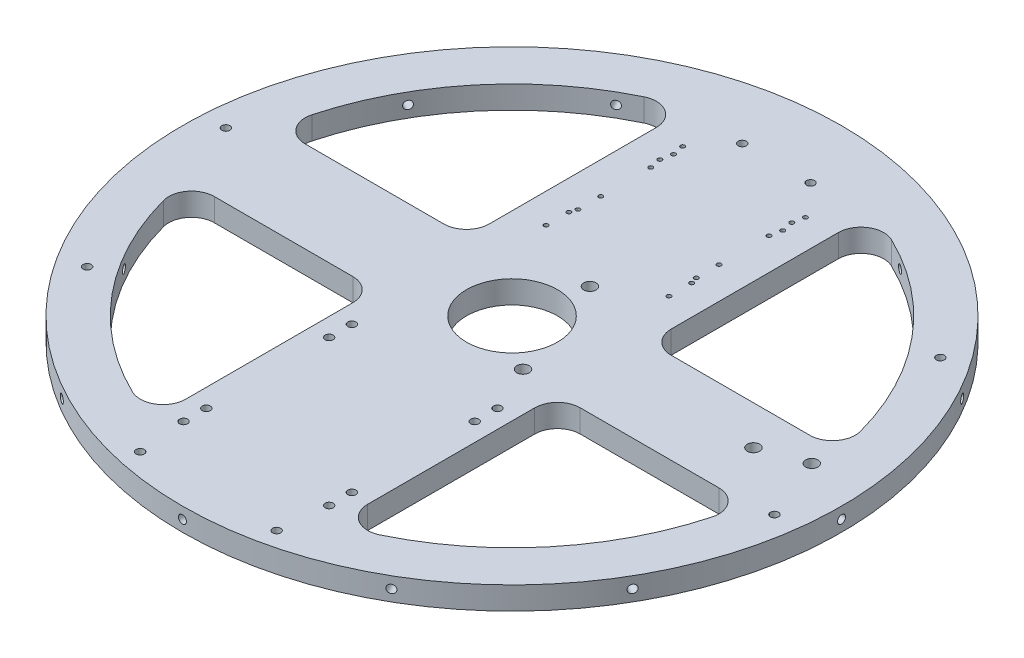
from build123d import *

# Parameters (mm, degrees)
SKETCH1_R             = 92
SKETCH1_R_2           = 12.7
BOSS_EXTRUDE1_DEPTH   = 6.35
CUT_EXTRUDE2_DEPTH    = 131.262513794
MIRROR2_COPY_1_DEPTH  = 131.262513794
F_0_80_TAPPED_HOLE1_D = 1.19126
LPATTERN1_COUNT       = 2
LPATTERN1_PITCH       = 6.35
F_4_40_TAPPED_HOLE1_D = 2.2606
LPATTERN2_COUNT       = 2
LPATTERN2_PITCH       = 6.35
F_8_32_TAPPED_HOLE1_D = 3.4544
CIRPATTERN1_COUNT     = 12
F_4_40_TAPPED_HOLE3_D = 2.2606
F_4_40_TAPPED_HOLE5_D = 2.2606


with BuildPart() as part:
    # Sketch1 → Boss-Extrude1 (new body)
    with BuildSketch(Plane(origin=(0, 0, 0), x_dir=(1, 0, 0), z_dir=(0, 1, 0))):
        with Locations(Location((0, 0, 0), (0, 0, 270))):
            Circle(SKETCH1_R)
        with Locations(Location((0, 0, 0), (0, 0, 270))):
            Circle(SKETCH1_R_2, mode=Mode.SUBTRACT)
    extrude(amount=BOSS_EXTRUDE1_DEPTH)

    # Sketch3 → Cut-Extrude2 (cut, through all)
    with BuildSketch(Plane(origin=(0, 6.35, 0), x_dir=(1, 0, 0), z_dir=(0, 1, 0))):
        with BuildLine():
            Line((70.418747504, -12.7), (31.75, -12.7))
            ThreePointArc((31.75, -12.7), (27.259871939, -14.559871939), (25.4, -19.05))
            Line((25.4, -19.05), (25.4, -65.678306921))
            ThreePointArc((25.4, -65.678306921), (28.375614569, -71.057528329), (34.513708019, -71.395335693))
            ThreePointArc((34.513708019, -71.395335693), (61.040924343, -50.621097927), (76.548412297, -20.708224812))
            ThreePointArc((76.548412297, -20.708224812), (75.46117884, -15.190416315), (70.418747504, -12.7))
        make_face()
    cut_extrude2 = extrude(amount=-CUT_EXTRUDE2_DEPTH, mode=Mode.SUBTRACT)

    # Mirror1: Cut-Extrude2 across plane
    add(cut_extrude2.mirror(Plane(origin=(0, 0, 0), x_dir=(0, 0, 1), z_dir=(1, 0, 0))), mode=Mode.SUBTRACT)

    # Mirror2: Cut-Extrude2 across plane
    add(cut_extrude2.mirror(Plane.XY), mode=Mode.SUBTRACT)

    # Mirror2 copy 1 sketch → Mirror2 copy 1 (cut, through all)
    with BuildSketch(Plane(origin=(0, 6.35, 0), x_dir=(-1, 0, 0), z_dir=(0, 1, 0))):
        with BuildLine():
            Line((70.418747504, -12.7), (31.75, -12.7))
            ThreePointArc((31.75, -12.7), (27.259871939, -14.559871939), (25.4, -19.05))
            Line((25.4, -19.05), (25.4, -65.678306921))
            ThreePointArc((25.4, -65.678306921), (28.375614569, -71.057528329), (34.513708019, -71.395335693))
            ThreePointArc((34.513708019, -71.395335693), (61.040924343, -50.621097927), (76.548412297, -20.708224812))
            ThreePointArc((76.548412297, -20.708224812), (75.46117884, -15.190416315), (70.418747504, -12.7))
        make_face()
    extrude(amount=-MIRROR2_COPY_1_DEPTH, mode=Mode.SUBTRACT)

    # 0-80 Tapped Hole1 (through all)
    with Locations(Plane(origin=(0, 6.35, 0), x_dir=(1, 0, 0), z_dir=(0, 1, 0))):
        with Locations((-17.145, 33.02), (17.145, 64.77), (-17.145, 64.77), (17.145, 33.02), (-16.51, 41.275), (-16.51, 61.595), (16.51, 61.595), (16.51, 41.275)):
            f_0_80_tapped_hole1 = Hole(F_0_80_TAPPED_HOLE1_D / 2)

    # LPattern1: 0-80 Tapped Hole1 ×2
    with Locations(*[(0, 0, i * LPATTERN1_PITCH) for i in range(1, LPATTERN1_COUNT)]):
        add(f_0_80_tapped_hole1, mode=Mode.SUBTRACT)

    # 4-40 Tapped Hole1 (through all)
    with Locations(Plane(origin=(0, 6.35, 0), x_dir=(1, 0, 0), z_dir=(0, 1, 0))):
        with Locations((-20.32, -30.734), (20.32, -30.734), (-20.32, -71.374), (20.32, -71.374)):
            f_4_40_tapped_hole1 = Hole(F_4_40_TAPPED_HOLE1_D / 2)

    # LPattern2: 4-40 Tapped Hole1 ×2
    with Locations(*[(0, 0, -i * LPATTERN2_PITCH) for i in range(1, LPATTERN2_COUNT)]):
        add(f_4_40_tapped_hole1, mode=Mode.SUBTRACT)

    # 8-32 Tapped Hole1 (through all)
    with Locations(Plane(origin=(0, 6.35, 0), x_dir=(1, 0, 0), z_dir=(0, 1, 0))):
        with Locations((65.582523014, 1.820322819), (77.516619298, 6.16397864), (3.757051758, 17.990975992), (14.442445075, -11.366900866)):
            Hole(F_8_32_TAPPED_HOLE1_D / 2)

    # Sketch12 → 4-40 Tapped Hole2 (revolve, cut)
    with BuildSketch(Plane(origin=(0, 3.175, 92), x_dir=(0, -1, 0), z_dir=(1, 0, 0))):
        Polygon((0, 0), (0, 13.379152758), (1.1303, 12.7), (1.1303, 0), align=None)
    f_4_40_tapped_hole2 = revolve(axis=Axis((0, 3.175, 98.35), (0, 0, -1)), mode=Mode.SUBTRACT)

    # CirPattern1: 4-40 Tapped Hole2 ×12 about axis
    cirpattern1_axis = Axis((0, 6.6675, 0), (0, -1, 0))
    for i in range(1, CIRPATTERN1_COUNT):
        add(f_4_40_tapped_hole2.rotate(cirpattern1_axis, i * 360 / CIRPATTERN1_COUNT), mode=Mode.SUBTRACT)

    # 4-40 Tapped Hole3 (through all)
    with Locations(Plane(origin=(0, 6.35, 0), x_dir=(1, 0, 0), z_dir=(0, 1, 0))):
        with Locations((-85.355975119, 5.49141824), (-71.174733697, -47.433695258)):
            Hole(F_4_40_TAPPED_HOLE3_D / 2)

    # 4-40 Tapped Hole5 (through all)
    with Locations(Plane(origin=(0, 6.35, 0), x_dir=(1, 0, 0), z_dir=(0, 1, 0))):
        with Locations((-19.05, -84.753447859), (19.05, -84.753447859), (84.666814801, -11.398465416), (69.878109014, 49.707017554), (-9.525, 73.809948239), (9.525, 73.809948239)):
            Hole(F_4_40_TAPPED_HOLE5_D / 2)


solid = part.part
